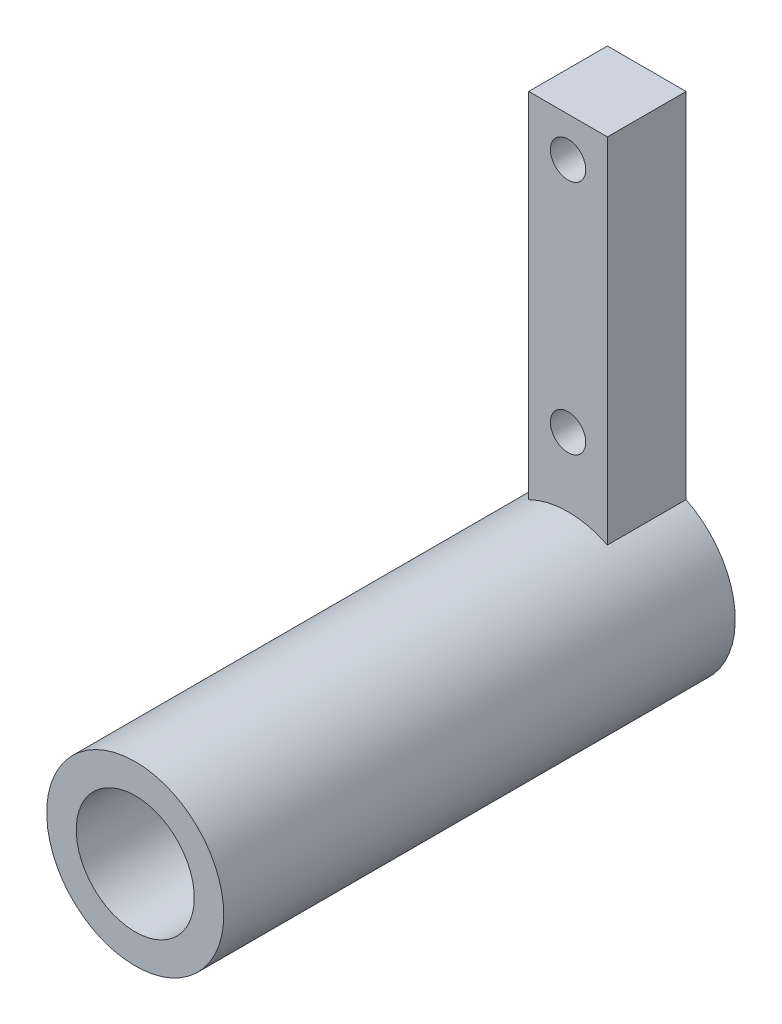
from build123d import *

# Parameters (mm, degrees)
ESQUISSE1_R             = 22.5
BASE_EXTRUSION_DEPTH    = 130
ESQUISSE2_W             = 20
ESQUISSE2_H             = 20
BOSS_EXTRU_1_DEPTH      = 110
ESQUISSE3_R             = 4.5
ENL_V_MAT_EXTRU_1_DEPTH = 20
ESQUISSE4_R             = 15
ENL_V_MAT_EXTRU_2_DEPTH = 120


with BuildPart() as part:
    # Esquisse1 → Base-Extrusion (new body)
    with BuildSketch(Plane.XY):
        with Locations(Location((0, 0, 0), (0, 0, 116.387799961))):
            Circle(ESQUISSE1_R)
    extrude(amount=BASE_EXTRUSION_DEPTH)

    # Esquisse2 → Boss.-Extru.1 (add)
    with BuildSketch(Plane(origin=(0, 0, 0), x_dir=(1, 0, 0), z_dir=(0, 1, 0))):
        with Locations((0, -10)):
            Rectangle(ESQUISSE2_W, ESQUISSE2_H)
    extrude(amount=BOSS_EXTRU_1_DEPTH)

    # Esquisse3 → Enl_v. mat.-Extru.1 (cut)
    with BuildSketch(Plane.XY.offset(20)):
        with Locations((0, 100)):
            Circle(ESQUISSE3_R)
        with Locations((0, 40)):
            Circle(ESQUISSE3_R)
    extrude(amount=-ENL_V_MAT_EXTRU_1_DEPTH, mode=Mode.SUBTRACT)

    # Esquisse4 → Enl_v. mat.-Extru.2 (cut)
    with BuildSketch(Plane.XY.offset(130)):
        Circle(ESQUISSE4_R)
    extrude(amount=-ENL_V_MAT_EXTRU_2_DEPTH, mode=Mode.SUBTRACT)


solid = part.part
